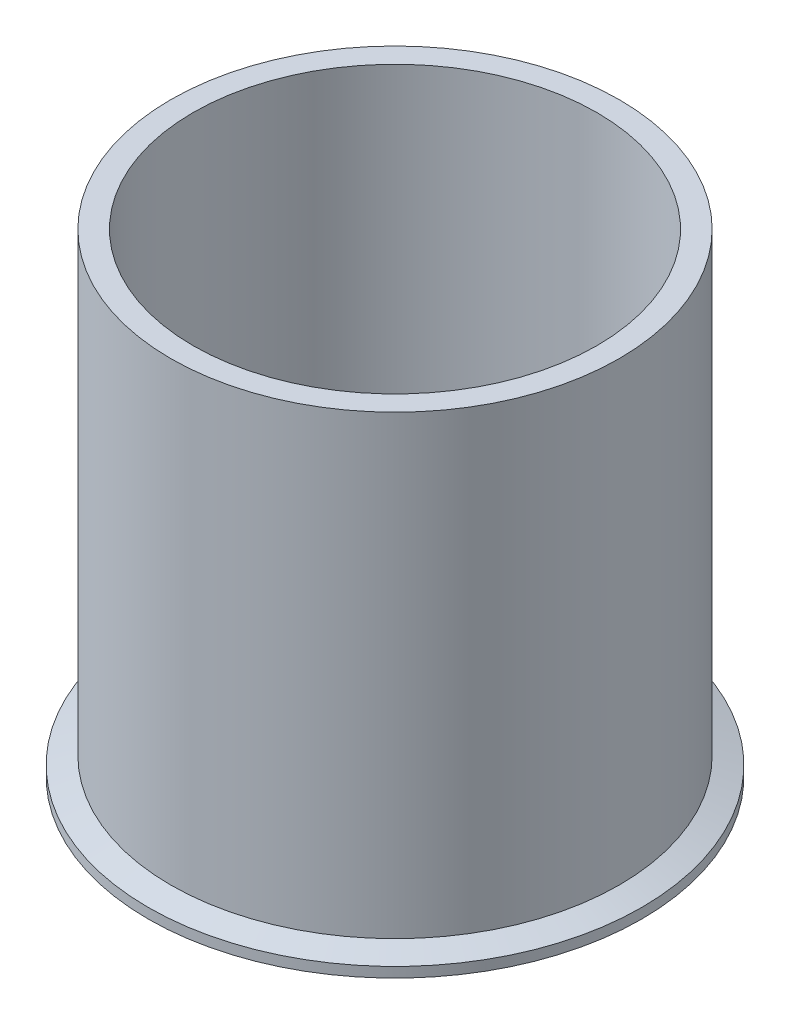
ISO-10303-21;
HEADER;
FILE_DESCRIPTION(('STEP AP214'),'2;1');
FILE_NAME('part.step','',(''),(''),'','','');
FILE_SCHEMA(('AUTOMOTIVE_DESIGN { 1 0 10303 214 1 1 1 1 }'));
ENDSEC;
DATA;
#1=APPLICATION_CONTEXT('core data for automotive mechanical design processes');
#2=APPLICATION_PROTOCOL_DEFINITION('international standard','automotive_design',2000,#1);
#3=PRODUCT_CONTEXT('',#1,'mechanical');
#4=PRODUCT('Part','Part','',(#3));
#5=PRODUCT_RELATED_PRODUCT_CATEGORY('part','',(#4));
#6=PRODUCT_DEFINITION_FORMATION('','',#4);
#7=PRODUCT_DEFINITION_CONTEXT('part definition',#1,'design');
#8=PRODUCT_DEFINITION('design','',#6,#7);
#9=PRODUCT_DEFINITION_SHAPE('','',#8);
#10=(LENGTH_UNIT() NAMED_UNIT(*) SI_UNIT(.MILLI.,.METRE.));
#11=(NAMED_UNIT(*) PLANE_ANGLE_UNIT() SI_UNIT($,.RADIAN.));
#12=(NAMED_UNIT(*) SI_UNIT($,.STERADIAN.) SOLID_ANGLE_UNIT());
#13=UNCERTAINTY_MEASURE_WITH_UNIT(LENGTH_MEASURE(1.E-05),#10,'distance_accuracy_value','');
#14=(GEOMETRIC_REPRESENTATION_CONTEXT(3) GLOBAL_UNCERTAINTY_ASSIGNED_CONTEXT((#13)) GLOBAL_UNIT_ASSIGNED_CONTEXT((#10,
#11,#12)) REPRESENTATION_CONTEXT('',''));
#15=CARTESIAN_POINT('',(0.,0.,0.));
#16=DIRECTION('',(0.,0.,1.));
#17=DIRECTION('',(1.,0.,0.));
#18=AXIS2_PLACEMENT_3D('',#15,#16,#17);
#19=CARTESIAN_POINT('',(0.,0.,0.));
#20=DIRECTION('',(0.,1.,0.));
#21=DIRECTION('',(0.,0.,1.));
#22=AXIS2_PLACEMENT_3D('',#19,#20,#21);
#23=PLANE('',#22);
#24=CARTESIAN_POINT('',(0.,0.,0.));
#25=DIRECTION('',(0.,-1.,0.));
#26=DIRECTION('',(0.,0.,-1.));
#27=AXIS2_PLACEMENT_3D('',#24,#25,#26);
#28=CIRCLE('',#27,56.7742603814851);
#29=CARTESIAN_POINT('',(0.,0.,-56.7742603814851));
#30=VERTEX_POINT('',#29);
#31=EDGE_CURVE('E10',#30,#30,#28,.T.);
#32=ORIENTED_EDGE('',*,*,#31,.F.);
#33=EDGE_LOOP('',(#32));
#34=FACE_BOUND('',#33,.T.);
#35=CARTESIAN_POINT('',(0.,0.,0.));
#36=DIRECTION('',(0.,-1.,0.));
#37=DIRECTION('',(0.,0.,-1.));
#38=AXIS2_PLACEMENT_3D('',#35,#36,#37);
#39=CIRCLE('',#38,59.4614);
#40=CARTESIAN_POINT('',(0.,0.,-59.4614));
#41=VERTEX_POINT('',#40);
#42=EDGE_CURVE('E73',#41,#41,#39,.T.);
#43=ORIENTED_EDGE('',*,*,#42,.T.);
#44=EDGE_LOOP('',(#43));
#45=FACE_BOUND('',#44,.T.);
#46=ADVANCED_FACE('F33',(#34,#45),#23,.F.);
#47=CARTESIAN_POINT('',(0.,0.762,0.));
#48=DIRECTION('',(0.,-1.,0.));
#49=DIRECTION('',(0.,0.,-1.));
#50=AXIS2_PLACEMENT_3D('',#47,#48,#49);
#51=TOROIDAL_SURFACE('',#50,56.7742603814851,0.762000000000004);
#52=CARTESIAN_POINT('',(0.,0.464262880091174,0.));
#53=DIRECTION('',(0.,-1.,0.));
#54=DIRECTION('',(0.,0.,-1.));
#55=AXIS2_PLACEMENT_3D('',#52,#53,#54);
#56=CIRCLE('',#55,56.0728356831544);
#57=CARTESIAN_POINT('',(0.,0.464262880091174,-56.0728356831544));
#58=VERTEX_POINT('',#57);
#59=EDGE_CURVE('E39',#58,#58,#56,.T.);
#60=ORIENTED_EDGE('',*,*,#59,.F.);
#61=EDGE_LOOP('',(#60));
#62=FACE_BOUND('',#61,.T.);
#63=ORIENTED_EDGE('',*,*,#31,.T.);
#64=EDGE_LOOP('',(#63));
#65=FACE_BOUND('',#64,.T.);
#66=ADVANCED_FACE('F114',(#62,#65),#51,.T.);
#67=CARTESIAN_POINT('',(0.,0.872854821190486,0.));
#68=DIRECTION('',(0.,-1.,0.));
#69=DIRECTION('',(0.,0.,-1.));
#70=AXIS2_PLACEMENT_3D('',#67,#68,#69);
#71=CONICAL_SURFACE('',#70,55.8993986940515,0.401425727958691);
#72=ORIENTED_EDGE('',*,*,#59,.T.);
#73=EDGE_LOOP('',(#72));
#74=FACE_BOUND('',#73,.T.);
#75=CARTESIAN_POINT('',(0.,0.872854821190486,0.));
#76=DIRECTION('',(0.,-1.,0.));
#77=DIRECTION('',(0.,0.,-1.));
#78=AXIS2_PLACEMENT_3D('',#75,#76,#77);
#79=CIRCLE('',#78,55.8993986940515);
#80=CARTESIAN_POINT('',(0.,0.872854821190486,-55.8993986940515));
#81=VERTEX_POINT('',#80);
#82=EDGE_CURVE('E43',#81,#81,#79,.T.);
#83=ORIENTED_EDGE('',*,*,#82,.F.);
#84=EDGE_LOOP('',(#83));
#85=FACE_BOUND('',#84,.T.);
#86=ADVANCED_FACE('F119',(#74,#85),#71,.F.);
#87=CARTESIAN_POINT('',(0.,0.4064,0.));
#88=DIRECTION('',(0.,-1.,0.));
#89=DIRECTION('',(0.,0.,-1.));
#90=AXIS2_PLACEMENT_3D('',#87,#88,#89);
#91=TOROIDAL_SURFACE('',#90,54.8005,1.1938);
#92=ORIENTED_EDGE('',*,*,#82,.T.);
#93=EDGE_LOOP('',(#92));
#94=FACE_BOUND('',#93,.T.);
#95=CARTESIAN_POINT('',(0.,0.872854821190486,0.));
#96=DIRECTION('',(0.,-1.,0.));
#97=DIRECTION('',(0.,0.,-1.));
#98=AXIS2_PLACEMENT_3D('',#95,#96,#97);
#99=CIRCLE('',#98,53.7016013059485);
#100=CARTESIAN_POINT('',(0.,0.872854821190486,-53.7016013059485));
#101=VERTEX_POINT('',#100);
#102=EDGE_CURVE('E47',#101,#101,#99,.T.);
#103=ORIENTED_EDGE('',*,*,#102,.F.);
#104=EDGE_LOOP('',(#103));
#105=FACE_BOUND('',#104,.T.);
#106=ADVANCED_FACE('F124',(#94,#105),#91,.F.);
#107=CARTESIAN_POINT('',(0.,0.872854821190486,0.));
#108=DIRECTION('',(0.,1.,0.));
#109=DIRECTION('',(0.,0.,1.));
#110=AXIS2_PLACEMENT_3D('',#107,#108,#109);
#111=CONICAL_SURFACE('',#110,53.7016013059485,0.401425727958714);
#112=CARTESIAN_POINT('',(0.,0.464262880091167,0.));
#113=DIRECTION('',(0.,-1.,0.));
#114=DIRECTION('',(0.,0.,-1.));
#115=AXIS2_PLACEMENT_3D('',#112,#113,#114);
#116=CIRCLE('',#115,53.5281643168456);
#117=CARTESIAN_POINT('',(0.,0.464262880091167,-53.5281643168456));
#118=VERTEX_POINT('',#117);
#119=EDGE_CURVE('E52',#118,#118,#116,.T.);
#120=ORIENTED_EDGE('',*,*,#119,.F.);
#121=EDGE_LOOP('',(#120));
#122=FACE_BOUND('',#121,.T.);
#123=ORIENTED_EDGE('',*,*,#102,.T.);
#124=EDGE_LOOP('',(#123));
#125=FACE_BOUND('',#124,.T.);
#126=ADVANCED_FACE('F129',(#122,#125),#111,.T.);
#127=CARTESIAN_POINT('',(0.,0.762,0.));
#128=DIRECTION('',(0.,-1.,0.));
#129=DIRECTION('',(0.,0.,-1.));
#130=AXIS2_PLACEMENT_3D('',#127,#128,#129);
#131=TOROIDAL_SURFACE('',#130,52.8267396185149,0.762000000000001);
#132=ORIENTED_EDGE('',*,*,#119,.T.);
#133=EDGE_LOOP('',(#132));
#134=FACE_BOUND('',#133,.T.);
#135=CARTESIAN_POINT('',(0.,0.,0.));
#136=DIRECTION('',(0.,-1.,0.));
#137=DIRECTION('',(0.,0.,-1.));
#138=AXIS2_PLACEMENT_3D('',#135,#136,#137);
#139=CIRCLE('',#138,52.8267396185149);
#140=CARTESIAN_POINT('',(0.,0.,-52.8267396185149));
#141=VERTEX_POINT('',#140);
#142=EDGE_CURVE('E55',#141,#141,#139,.T.);
#143=ORIENTED_EDGE('',*,*,#142,.F.);
#144=EDGE_LOOP('',(#143));
#145=FACE_BOUND('',#144,.T.);
#146=ADVANCED_FACE('F110',(#134,#145),#131,.T.);
#147=CARTESIAN_POINT('',(0.,0.,0.));
#148=DIRECTION('',(0.,1.,0.));
#149=DIRECTION('',(0.,0.,1.));
#150=AXIS2_PLACEMENT_3D('',#147,#148,#149);
#151=PLANE('',#150);
#152=CARTESIAN_POINT('',(0.,0.,0.));
#153=DIRECTION('',(0.,-1.,0.));
#154=DIRECTION('',(0.,0.,-1.));
#155=AXIS2_PLACEMENT_3D('',#152,#153,#154);
#156=CIRCLE('',#155,48.6664);
#157=CARTESIAN_POINT('',(0.,0.,-48.6664));
#158=VERTEX_POINT('',#157);
#159=EDGE_CURVE('E58',#158,#158,#156,.T.);
#160=ORIENTED_EDGE('',*,*,#159,.F.);
#161=EDGE_LOOP('',(#160));
#162=FACE_BOUND('',#161,.T.);
#163=ORIENTED_EDGE('',*,*,#142,.T.);
#164=EDGE_LOOP('',(#163));
#165=FACE_BOUND('',#164,.T.);
#166=ADVANCED_FACE('F104',(#162,#165),#151,.F.);
#167=CARTESIAN_POINT('',(0.,0.,0.));
#168=DIRECTION('',(0.,-1.,0.));
#169=DIRECTION('',(0.,0.,-1.));
#170=AXIS2_PLACEMENT_3D('',#167,#168,#169);
#171=CYLINDRICAL_SURFACE('',#170,48.6664);
#172=ORIENTED_EDGE('',*,*,#159,.T.);
#173=EDGE_LOOP('',(#172));
#174=FACE_BOUND('',#173,.T.);
#175=CARTESIAN_POINT('',(0.,114.3,0.));
#176=DIRECTION('',(0.,-1.,0.));
#177=DIRECTION('',(0.,0.,-1.));
#178=AXIS2_PLACEMENT_3D('',#175,#176,#177);
#179=CIRCLE('',#178,48.6664);
#180=CARTESIAN_POINT('',(0.,114.3,-48.6664));
#181=VERTEX_POINT('',#180);
#182=EDGE_CURVE('E61',#181,#181,#179,.T.);
#183=ORIENTED_EDGE('',*,*,#182,.F.);
#184=EDGE_LOOP('',(#183));
#185=FACE_BOUND('',#184,.T.);
#186=ADVANCED_FACE('F99',(#174,#185),#171,.F.);
#187=CARTESIAN_POINT('',(0.,114.3,0.));
#188=DIRECTION('',(0.,-1.,0.));
#189=DIRECTION('',(0.,0.,-1.));
#190=AXIS2_PLACEMENT_3D('',#187,#188,#189);
#191=PLANE('',#190);
#192=CARTESIAN_POINT('',(0.,114.3,0.));
#193=DIRECTION('',(0.,-1.,0.));
#194=DIRECTION('',(0.,0.,-1.));
#195=AXIS2_PLACEMENT_3D('',#192,#193,#194);
#196=CIRCLE('',#195,54.0512);
#197=CARTESIAN_POINT('',(0.,114.3,-54.0512));
#198=VERTEX_POINT('',#197);
#199=EDGE_CURVE('E64',#198,#198,#196,.T.);
#200=ORIENTED_EDGE('',*,*,#199,.F.);
#201=EDGE_LOOP('',(#200));
#202=FACE_BOUND('',#201,.T.);
#203=ORIENTED_EDGE('',*,*,#182,.T.);
#204=EDGE_LOOP('',(#203));
#205=FACE_BOUND('',#204,.T.);
#206=ADVANCED_FACE('F93',(#202,#205),#191,.F.);
#207=CARTESIAN_POINT('',(0.,0.,0.));
#208=DIRECTION('',(0.,-1.,0.));
#209=DIRECTION('',(0.,0.,-1.));
#210=AXIS2_PLACEMENT_3D('',#207,#208,#209);
#211=CYLINDRICAL_SURFACE('',#210,54.0512);
#212=CARTESIAN_POINT('',(0.,4.40755176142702,0.));
#213=DIRECTION('',(0.,-1.,0.));
#214=DIRECTION('',(0.,0.,-1.));
#215=AXIS2_PLACEMENT_3D('',#212,#213,#214);
#216=CIRCLE('',#215,54.0512);
#217=CARTESIAN_POINT('',(0.,4.40755176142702,-54.0512));
#218=VERTEX_POINT('',#217);
#219=EDGE_CURVE('E67',#218,#218,#216,.T.);
#220=ORIENTED_EDGE('',*,*,#219,.F.);
#221=EDGE_LOOP('',(#220));
#222=FACE_BOUND('',#221,.T.);
#223=ORIENTED_EDGE('',*,*,#199,.T.);
#224=EDGE_LOOP('',(#223));
#225=FACE_BOUND('',#224,.T.);
#226=ADVANCED_FACE('F87',(#222,#225),#211,.T.);
#227=CARTESIAN_POINT('',(0.,4.40755176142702,0.));
#228=DIRECTION('',(0.,-1.,0.));
#229=DIRECTION('',(0.,0.,-1.));
#230=AXIS2_PLACEMENT_3D('',#227,#228,#229);
#231=CONICAL_SURFACE('',#230,54.0512,1.22173047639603);
#232=CARTESIAN_POINT('',(0.,2.4384,0.));
#233=DIRECTION('',(0.,-1.,0.));
#234=DIRECTION('',(0.,0.,-1.));
#235=AXIS2_PLACEMENT_3D('',#232,#233,#234);
#236=CIRCLE('',#235,59.4614);
#237=CARTESIAN_POINT('',(0.,2.4384,-59.4614));
#238=VERTEX_POINT('',#237);
#239=EDGE_CURVE('E70',#238,#238,#236,.T.);
#240=ORIENTED_EDGE('',*,*,#239,.F.);
#241=EDGE_LOOP('',(#240));
#242=FACE_BOUND('',#241,.T.);
#243=ORIENTED_EDGE('',*,*,#219,.T.);
#244=EDGE_LOOP('',(#243));
#245=FACE_BOUND('',#244,.T.);
#246=ADVANCED_FACE('F81',(#242,#245),#231,.T.);
#247=CARTESIAN_POINT('',(0.,0.,0.));
#248=DIRECTION('',(0.,-1.,0.));
#249=DIRECTION('',(0.,0.,-1.));
#250=AXIS2_PLACEMENT_3D('',#247,#248,#249);
#251=CYLINDRICAL_SURFACE('',#250,59.4614);
#252=ORIENTED_EDGE('',*,*,#42,.F.);
#253=EDGE_LOOP('',(#252));
#254=FACE_BOUND('',#253,.T.);
#255=ORIENTED_EDGE('',*,*,#239,.T.);
#256=EDGE_LOOP('',(#255));
#257=FACE_BOUND('',#256,.T.);
#258=ADVANCED_FACE('F78',(#254,#257),#251,.T.);
#259=CLOSED_SHELL('',(#46,#66,#86,#106,#126,#146,#166,#186,#206,#226,#246,#258));
#260=MANIFOLD_SOLID_BREP('B2',#259);
#261=ADVANCED_BREP_SHAPE_REPRESENTATION('',(#18,#260),#14);
#262=SHAPE_DEFINITION_REPRESENTATION(#9,#261);
ENDSEC;
END-ISO-10303-21;
